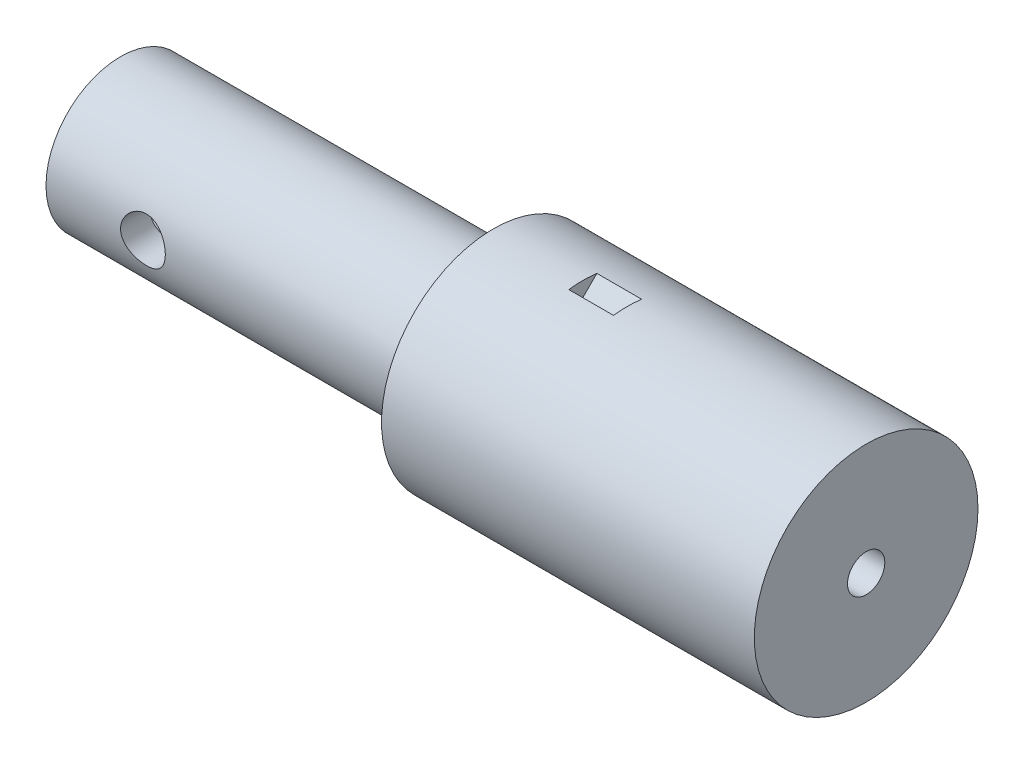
ISO-10303-21;
HEADER;
FILE_DESCRIPTION(('STEP AP214'),'2;1');
FILE_NAME('part.step','',(''),(''),'','','');
FILE_SCHEMA(('AUTOMOTIVE_DESIGN { 1 0 10303 214 1 1 1 1 }'));
ENDSEC;
DATA;
#1=APPLICATION_CONTEXT('core data for automotive mechanical design processes');
#2=APPLICATION_PROTOCOL_DEFINITION('international standard','automotive_design',2000,#1);
#3=PRODUCT_CONTEXT('',#1,'mechanical');
#4=PRODUCT('Part','Part','',(#3));
#5=PRODUCT_RELATED_PRODUCT_CATEGORY('part','',(#4));
#6=PRODUCT_DEFINITION_FORMATION('','',#4);
#7=PRODUCT_DEFINITION_CONTEXT('part definition',#1,'design');
#8=PRODUCT_DEFINITION('design','',#6,#7);
#9=PRODUCT_DEFINITION_SHAPE('','',#8);
#10=(LENGTH_UNIT() NAMED_UNIT(*) SI_UNIT(.MILLI.,.METRE.));
#11=(NAMED_UNIT(*) PLANE_ANGLE_UNIT() SI_UNIT($,.RADIAN.));
#12=(NAMED_UNIT(*) SI_UNIT($,.STERADIAN.) SOLID_ANGLE_UNIT());
#13=UNCERTAINTY_MEASURE_WITH_UNIT(LENGTH_MEASURE(1.E-05),#10,'distance_accuracy_value','');
#14=(GEOMETRIC_REPRESENTATION_CONTEXT(3) GLOBAL_UNCERTAINTY_ASSIGNED_CONTEXT((#13)) GLOBAL_UNIT_ASSIGNED_CONTEXT((#10,
#11,#12)) REPRESENTATION_CONTEXT('',''));
#15=CARTESIAN_POINT('',(0.,0.,0.));
#16=DIRECTION('',(0.,0.,1.));
#17=DIRECTION('',(1.,0.,0.));
#18=AXIS2_PLACEMENT_3D('',#15,#16,#17);
#19=CARTESIAN_POINT('',(50.,0.,0.));
#20=DIRECTION('',(-1.,0.,0.));
#21=DIRECTION('',(0.,0.,1.));
#22=AXIS2_PLACEMENT_3D('',#19,#20,#21);
#23=CYLINDRICAL_SURFACE('',#22,15.);
#24=CARTESIAN_POINT('',(0.,0.,0.));
#25=DIRECTION('',(1.,0.,0.));
#26=DIRECTION('',(0.,0.,-1.));
#27=AXIS2_PLACEMENT_3D('',#24,#25,#26);
#28=CIRCLE('',#27,15.);
#29=CARTESIAN_POINT('',(0.,0.,-15.));
#30=VERTEX_POINT('',#29);
#31=EDGE_CURVE('E162',#30,#30,#28,.T.);
#32=ORIENTED_EDGE('',*,*,#31,.T.);
#33=EDGE_LOOP('',(#32));
#34=FACE_BOUND('',#33,.T.);
#35=CARTESIAN_POINT('',(50.,0.,0.));
#36=DIRECTION('',(1.,0.,0.));
#37=DIRECTION('',(0.,0.,-1.));
#38=AXIS2_PLACEMENT_3D('',#35,#36,#37);
#39=CIRCLE('',#38,15.);
#40=CARTESIAN_POINT('',(50.,0.,-15.));
#41=VERTEX_POINT('',#40);
#42=EDGE_CURVE('E163',#41,#41,#39,.T.);
#43=ORIENTED_EDGE('',*,*,#42,.F.);
#44=EDGE_LOOP('',(#43));
#45=FACE_BOUND('',#44,.T.);
#46=CARTESIAN_POINT('',(12.,0.,0.));
#47=DIRECTION('',(1.,0.,0.));
#48=DIRECTION('',(0.,0.,-1.));
#49=AXIS2_PLACEMENT_3D('',#46,#47,#48);
#50=CIRCLE('',#49,15.);
#51=CARTESIAN_POINT('',(12.,14.8815273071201,-1.88152730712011));
#52=VERTEX_POINT('',#51);
#53=CARTESIAN_POINT('',(12.,14.8815273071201,1.88152730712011));
#54=VERTEX_POINT('',#53);
#55=EDGE_CURVE('E85',#52,#54,#50,.T.);
#56=ORIENTED_EDGE('',*,*,#55,.F.);
#57=DIRECTION('',(1.,0.,0.));
#58=VECTOR('',#57,1.);
#59=CARTESIAN_POINT('',(12.,14.8815273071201,-1.88152730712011));
#60=LINE('',#59,#58);
#61=CARTESIAN_POINT('',(18.,14.8815273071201,-1.88152730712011));
#62=VERTEX_POINT('',#61);
#63=EDGE_CURVE('E62',#52,#62,#60,.T.);
#64=ORIENTED_EDGE('',*,*,#63,.T.);
#65=CARTESIAN_POINT('',(18.,0.,0.));
#66=DIRECTION('',(1.,0.,0.));
#67=DIRECTION('',(0.,0.,-1.));
#68=AXIS2_PLACEMENT_3D('',#65,#66,#67);
#69=CIRCLE('',#68,15.);
#70=CARTESIAN_POINT('',(18.,14.8815273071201,1.88152730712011));
#71=VERTEX_POINT('',#70);
#72=EDGE_CURVE('E73',#62,#71,#69,.T.);
#73=ORIENTED_EDGE('',*,*,#72,.T.);
#74=DIRECTION('',(1.,0.,0.));
#75=VECTOR('',#74,1.);
#76=CARTESIAN_POINT('',(12.,14.8815273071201,1.88152730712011));
#77=LINE('',#76,#75);
#78=EDGE_CURVE('E81',#54,#71,#77,.T.);
#79=ORIENTED_EDGE('',*,*,#78,.F.);
#80=EDGE_LOOP('',(#56,#64,#73,#79));
#81=FACE_BOUND('',#80,.T.);
#82=ADVANCED_FACE('F32',(#34,#45,#81),#23,.T.);
#83=CARTESIAN_POINT('',(50.,0.,0.));
#84=DIRECTION('',(1.,0.,0.));
#85=DIRECTION('',(0.,0.,-1.));
#86=AXIS2_PLACEMENT_3D('',#83,#84,#85);
#87=PLANE('',#86);
#88=CARTESIAN_POINT('',(50.,0.,0.));
#89=DIRECTION('',(1.,0.,0.));
#90=DIRECTION('',(0.,0.,-1.));
#91=AXIS2_PLACEMENT_3D('',#88,#89,#90);
#92=CIRCLE('',#91,2.5);
#93=CARTESIAN_POINT('',(50.,0.,-2.5));
#94=VERTEX_POINT('',#93);
#95=EDGE_CURVE('E186',#94,#94,#92,.T.);
#96=ORIENTED_EDGE('',*,*,#95,.F.);
#97=EDGE_LOOP('',(#96));
#98=FACE_BOUND('',#97,.T.);
#99=ORIENTED_EDGE('',*,*,#42,.T.);
#100=EDGE_LOOP('',(#99));
#101=FACE_BOUND('',#100,.T.);
#102=ADVANCED_FACE('F144',(#98,#101),#87,.T.);
#103=CARTESIAN_POINT('',(0.,0.,0.));
#104=DIRECTION('',(1.,0.,0.));
#105=DIRECTION('',(0.,0.,-1.));
#106=AXIS2_PLACEMENT_3D('',#103,#104,#105);
#107=PLANE('',#106);
#108=CARTESIAN_POINT('',(0.,0.,0.));
#109=DIRECTION('',(1.,0.,0.));
#110=DIRECTION('',(0.,0.,-1.));
#111=AXIS2_PLACEMENT_3D('',#108,#109,#110);
#112=CIRCLE('',#111,10.);
#113=CARTESIAN_POINT('',(0.,0.,-10.));
#114=VERTEX_POINT('',#113);
#115=EDGE_CURVE('E160',#114,#114,#112,.F.);
#116=ORIENTED_EDGE('',*,*,#115,.F.);
#117=EDGE_LOOP('',(#116));
#118=FACE_BOUND('',#117,.T.);
#119=ORIENTED_EDGE('',*,*,#31,.F.);
#120=EDGE_LOOP('',(#119));
#121=FACE_BOUND('',#120,.T.);
#122=ADVANCED_FACE('F139',(#118,#121),#107,.F.);
#123=CARTESIAN_POINT('',(-50.,0.,0.));
#124=DIRECTION('',(1.,0.,0.));
#125=DIRECTION('',(0.,0.,-1.));
#126=AXIS2_PLACEMENT_3D('',#123,#124,#125);
#127=CYLINDRICAL_SURFACE('',#126,10.);
#128=CARTESIAN_POINT('',(-40.,0.,-10.));
#129=CARTESIAN_POINT('',(-39.9999980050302,-0.1645772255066,-9.99999858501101));
#130=CARTESIAN_POINT('',(-39.9864122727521,-0.329174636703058,-9.99589831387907));
#131=CARTESIAN_POINT('',(-39.9325572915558,-0.653576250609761,-9.97994211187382));
#132=CARTESIAN_POINT('',(-39.8922800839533,-0.813379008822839,-9.96808386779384));
#133=CARTESIAN_POINT('',(-39.7865079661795,-1.12346541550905,-9.93791105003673));
#134=CARTESIAN_POINT('',(-39.7210502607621,-1.27376272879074,-9.91960600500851));
#135=CARTESIAN_POINT('',(-39.5669278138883,-1.56124836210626,-9.87844218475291));
#136=CARTESIAN_POINT('',(-39.4782599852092,-1.69843493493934,-9.85558280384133));
#137=CARTESIAN_POINT('',(-39.2775519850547,-1.95974359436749,-9.80701474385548));
#138=CARTESIAN_POINT('',(-39.1649667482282,-2.08343614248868,-9.78124767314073));
#139=CARTESIAN_POINT('',(-38.9207815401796,-2.31049841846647,-9.73011668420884));
#140=CARTESIAN_POINT('',(-38.7891783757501,-2.41386472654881,-9.70475283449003));
#141=CARTESIAN_POINT('',(-38.5070584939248,-2.59960075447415,-9.65668227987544));
#142=CARTESIAN_POINT('',(-38.3561830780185,-2.68144618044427,-9.63404813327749));
#143=CARTESIAN_POINT('',(-38.0420214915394,-2.81842789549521,-9.59487240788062));
#144=CARTESIAN_POINT('',(-37.8787383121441,-2.87357059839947,-9.57832936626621));
#145=CARTESIAN_POINT('',(-37.5492194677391,-2.95403267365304,-9.55381741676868));
#146=CARTESIAN_POINT('',(-37.3831945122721,-2.98014392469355,-9.54562138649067));
#147=CARTESIAN_POINT('',(-37.0489336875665,-3.00427461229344,-9.53805579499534));
#148=CARTESIAN_POINT('',(-36.8806983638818,-3.00230085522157,-9.53868409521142));
#149=CARTESIAN_POINT('',(-36.553232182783,-2.97093954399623,-9.54849488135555));
#150=CARTESIAN_POINT('',(-36.3938954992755,-2.9425441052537,-9.55736777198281));
#151=CARTESIAN_POINT('',(-36.0823604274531,-2.86074840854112,-9.58216712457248));
#152=CARTESIAN_POINT('',(-35.9301627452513,-2.80734568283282,-9.59809428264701));
#153=CARTESIAN_POINT('',(-35.6347993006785,-2.67632053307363,-9.63545466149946));
#154=CARTESIAN_POINT('',(-35.4917858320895,-2.59837633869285,-9.65696032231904));
#155=CARTESIAN_POINT('',(-35.2205359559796,-2.42070445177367,-9.70301974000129));
#156=CARTESIAN_POINT('',(-35.0923031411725,-2.32097148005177,-9.72757423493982));
#157=CARTESIAN_POINT('',(-34.848627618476,-2.09762581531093,-9.77822022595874));
#158=CARTESIAN_POINT('',(-34.7339426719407,-1.97318981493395,-9.80433308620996));
#159=CARTESIAN_POINT('',(-34.5268920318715,-1.70652651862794,-9.85424488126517));
#160=CARTESIAN_POINT('',(-34.4345277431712,-1.56429810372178,-9.8780436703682));
#161=CARTESIAN_POINT('',(-34.2742801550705,-1.26471007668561,-9.92086320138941));
#162=CARTESIAN_POINT('',(-34.2065649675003,-1.1072554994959,-9.93985087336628));
#163=CARTESIAN_POINT('',(-34.0988008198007,-0.782490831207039,-9.97067043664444));
#164=CARTESIAN_POINT('',(-34.058744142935,-0.615183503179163,-9.98250432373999));
#165=CARTESIAN_POINT('',(-34.0086956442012,-0.281904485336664,-9.99736729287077));
#166=CARTESIAN_POINT('',(-33.9976768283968,-0.116100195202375,-10.0006970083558));
#167=CARTESIAN_POINT('',(-34.0031383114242,0.214999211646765,-9.99905846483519));
#168=CARTESIAN_POINT('',(-34.0196149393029,0.380294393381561,-9.99409131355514));
#169=CARTESIAN_POINT('',(-34.078769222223,0.701807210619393,-9.97661393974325));
#170=CARTESIAN_POINT('',(-34.1208467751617,0.858145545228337,-9.96427659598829));
#171=CARTESIAN_POINT('',(-34.2292864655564,1.16150927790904,-9.9334869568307));
#172=CARTESIAN_POINT('',(-34.2956515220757,1.30853355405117,-9.91503392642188));
#173=CARTESIAN_POINT('',(-34.4525063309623,1.5928743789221,-9.87339308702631));
#174=CARTESIAN_POINT('',(-34.543518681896,1.72988765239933,-9.8501056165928));
#175=CARTESIAN_POINT('',(-34.7464495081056,1.9870466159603,-9.80146937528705));
#176=CARTESIAN_POINT('',(-34.8583732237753,2.10718806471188,-9.7761200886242));
#177=CARTESIAN_POINT('',(-35.1047746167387,2.33171489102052,-9.72506343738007));
#178=CARTESIAN_POINT('',(-35.2399237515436,2.43536962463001,-9.69937650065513));
#179=CARTESIAN_POINT('',(-35.5262558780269,2.61857990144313,-9.65153030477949));
#180=CARTESIAN_POINT('',(-35.6774384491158,2.69813607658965,-9.62937095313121));
#181=CARTESIAN_POINT('',(-35.99106498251,2.83034694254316,-9.5913437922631));
#182=CARTESIAN_POINT('',(-36.1534523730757,2.88312693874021,-9.57544675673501));
#183=CARTESIAN_POINT('',(-36.4853759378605,2.96043461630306,-9.55183188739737));
#184=CARTESIAN_POINT('',(-36.6549096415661,2.98497197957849,-9.54411125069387));
#185=CARTESIAN_POINT('',(-36.9887230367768,3.0044396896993,-9.53799944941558));
#186=CARTESIAN_POINT('',(-37.1529273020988,3.00056110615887,-9.53923294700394));
#187=CARTESIAN_POINT('',(-37.4782282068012,2.9661501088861,-9.54998802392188));
#188=CARTESIAN_POINT('',(-37.639324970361,2.93561876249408,-9.55950927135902));
#189=CARTESIAN_POINT('',(-37.9518907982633,2.84953777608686,-9.58551527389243));
#190=CARTESIAN_POINT('',(-38.1034545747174,2.79430351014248,-9.60191209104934));
#191=CARTESIAN_POINT('',(-38.3952848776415,2.66063014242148,-9.63980557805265));
#192=CARTESIAN_POINT('',(-38.5355492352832,2.58218659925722,-9.6613032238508));
#193=CARTESIAN_POINT('',(-38.8063262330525,2.40097527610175,-9.70795352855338));
#194=CARTESIAN_POINT('',(-38.9362975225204,2.29742552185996,-9.7332108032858));
#195=CARTESIAN_POINT('',(-39.1774049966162,2.07034869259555,-9.78402640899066));
#196=CARTESIAN_POINT('',(-39.2885362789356,1.94681643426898,-9.80958481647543));
#197=CARTESIAN_POINT('',(-39.4920468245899,1.67893152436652,-9.85901873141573));
#198=CARTESIAN_POINT('',(-39.583782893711,1.53407577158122,-9.88282319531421));
#199=CARTESIAN_POINT('',(-39.7414703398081,1.23028274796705,-9.92521360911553));
#200=CARTESIAN_POINT('',(-39.807433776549,1.07135210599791,-9.94380199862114));
#201=CARTESIAN_POINT('',(-39.9057905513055,0.761515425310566,-9.97204349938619));
#202=CARTESIAN_POINT('',(-39.9410233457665,0.61157392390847,-9.9824405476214));
#203=CARTESIAN_POINT('',(-39.9881270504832,0.307760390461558,-9.9964188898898));
#204=CARTESIAN_POINT('',(-40.0000018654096,0.153889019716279,-10.0000013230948));
#205=CARTESIAN_POINT('',(-40.,0.,-10.));
#206=B_SPLINE_CURVE_WITH_KNOTS('',3,(#128,#129,#130,#131,#132,#133,#134,#135,#136,#137,#138,
#139,#140,#141,#142,#143,#144,#145,#146,#147,#148,#149,#150,#151,#152,#153,#154,#155,#156,#157,
#158,#159,#160,#161,#162,#163,#164,#165,#166,#167,#168,#169,#170,#171,#172,#173,#174,#175,#176,
#177,#178,#179,#180,#181,#182,#183,#184,#185,#186,#187,#188,#189,#190,#191,#192,#193,#194,#195,
#196,#197,#198,#199,#200,#201,#202,#203,#204,#205),.UNSPECIFIED.,.T.,.F.,(4,2,2,2,2,2,2,2,2,2,2,
2,2,2,2,2,2,2,2,2,2,2,2,2,2,2,2,2,2,2,2,2,2,2,2,2,2,2,4),(0.,0.49316640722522,0.986479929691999,
1.47906735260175,1.9717203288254,2.47711205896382,2.98258874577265,3.49942962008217,
4.01614629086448,4.51839378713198,5.02051956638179,5.50452033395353,5.98856887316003,
6.47924852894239,6.97004720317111,7.48134208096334,7.99266913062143,8.50742093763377,
9.02202907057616,9.5181761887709,10.0142570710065,10.4991349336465,10.9840710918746,
11.4802261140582,11.9765056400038,12.4908080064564,13.0050968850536,13.516956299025,
14.0286401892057,14.5190031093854,15.0093463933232,15.4936008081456,15.9779479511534,
16.4799385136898,16.9820594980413,17.4988599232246,18.0154182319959,18.4766338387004,
18.9377723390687),.UNSPECIFIED.);
#207=CARTESIAN_POINT('',(-40.,0.,-10.));
#208=VERTEX_POINT('',#207);
#209=EDGE_CURVE('E103',#208,#208,#206,.T.);
#210=ORIENTED_EDGE('',*,*,#209,.T.);
#211=EDGE_LOOP('',(#210));
#212=FACE_BOUND('',#211,.T.);
#213=CARTESIAN_POINT('',(-34.,0.,10.));
#214=CARTESIAN_POINT('',(-34.0000019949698,-0.164577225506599,9.99999858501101));
#215=CARTESIAN_POINT('',(-34.0135877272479,-0.329174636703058,9.99589831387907));
#216=CARTESIAN_POINT('',(-34.0674427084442,-0.65357625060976,9.97994211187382));
#217=CARTESIAN_POINT('',(-34.1077199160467,-0.813379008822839,9.96808386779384));
#218=CARTESIAN_POINT('',(-34.2134920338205,-1.12346541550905,9.93791105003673));
#219=CARTESIAN_POINT('',(-34.2789497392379,-1.27376272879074,9.91960600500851));
#220=CARTESIAN_POINT('',(-34.4330721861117,-1.56124836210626,9.87844218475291));
#221=CARTESIAN_POINT('',(-34.5217400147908,-1.69843493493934,9.85558280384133));
#222=CARTESIAN_POINT('',(-34.7224480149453,-1.95974359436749,9.80701474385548));
#223=CARTESIAN_POINT('',(-34.8350332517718,-2.08343614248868,9.78124767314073));
#224=CARTESIAN_POINT('',(-35.0792184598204,-2.31049841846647,9.73011668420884));
#225=CARTESIAN_POINT('',(-35.2108216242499,-2.41386472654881,9.70475283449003));
#226=CARTESIAN_POINT('',(-35.4929415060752,-2.59960075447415,9.65668227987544));
#227=CARTESIAN_POINT('',(-35.6438169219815,-2.68144618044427,9.63404813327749));
#228=CARTESIAN_POINT('',(-35.9579785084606,-2.81842789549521,9.59487240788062));
#229=CARTESIAN_POINT('',(-36.121261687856,-2.87357059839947,9.57832936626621));
#230=CARTESIAN_POINT('',(-36.4507805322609,-2.95403267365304,9.55381741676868));
#231=CARTESIAN_POINT('',(-36.6168054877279,-2.98014392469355,9.54562138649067));
#232=CARTESIAN_POINT('',(-36.9510663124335,-3.00427461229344,9.53805579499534));
#233=CARTESIAN_POINT('',(-37.1193016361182,-3.00230085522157,9.53868409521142));
#234=CARTESIAN_POINT('',(-37.446767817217,-2.97093954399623,9.54849488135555));
#235=CARTESIAN_POINT('',(-37.6061045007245,-2.9425441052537,9.55736777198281));
#236=CARTESIAN_POINT('',(-37.9176395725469,-2.86074840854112,9.58216712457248));
#237=CARTESIAN_POINT('',(-38.0698372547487,-2.80734568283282,9.59809428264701));
#238=CARTESIAN_POINT('',(-38.3652006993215,-2.67632053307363,9.63545466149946));
#239=CARTESIAN_POINT('',(-38.5082141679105,-2.59837633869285,9.65696032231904));
#240=CARTESIAN_POINT('',(-38.7794640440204,-2.42070445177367,9.70301974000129));
#241=CARTESIAN_POINT('',(-38.9076968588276,-2.32097148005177,9.72757423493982));
#242=CARTESIAN_POINT('',(-39.151372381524,-2.09762581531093,9.77822022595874));
#243=CARTESIAN_POINT('',(-39.2660573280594,-1.97318981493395,9.80433308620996));
#244=CARTESIAN_POINT('',(-39.4731079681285,-1.70652651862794,9.85424488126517));
#245=CARTESIAN_POINT('',(-39.5654722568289,-1.56429810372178,9.8780436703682));
#246=CARTESIAN_POINT('',(-39.7257198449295,-1.26471007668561,9.92086320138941));
#247=CARTESIAN_POINT('',(-39.7934350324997,-1.1072554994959,9.93985087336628));
#248=CARTESIAN_POINT('',(-39.9011991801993,-0.782490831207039,9.97067043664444));
#249=CARTESIAN_POINT('',(-39.941255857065,-0.615183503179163,9.98250432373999));
#250=CARTESIAN_POINT('',(-39.9913043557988,-0.281904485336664,9.99736729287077));
#251=CARTESIAN_POINT('',(-40.0023231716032,-0.116100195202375,10.0006970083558));
#252=CARTESIAN_POINT('',(-39.9968616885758,0.214999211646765,9.99905846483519));
#253=CARTESIAN_POINT('',(-39.9803850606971,0.380294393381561,9.99409131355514));
#254=CARTESIAN_POINT('',(-39.921230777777,0.701807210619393,9.97661393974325));
#255=CARTESIAN_POINT('',(-39.8791532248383,0.858145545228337,9.96427659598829));
#256=CARTESIAN_POINT('',(-39.7707135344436,1.16150927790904,9.9334869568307));
#257=CARTESIAN_POINT('',(-39.7043484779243,1.30853355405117,9.91503392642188));
#258=CARTESIAN_POINT('',(-39.5474936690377,1.5928743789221,9.87339308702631));
#259=CARTESIAN_POINT('',(-39.4564813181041,1.72988765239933,9.8501056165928));
#260=CARTESIAN_POINT('',(-39.2535504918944,1.9870466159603,9.80146937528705));
#261=CARTESIAN_POINT('',(-39.1416267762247,2.10718806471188,9.7761200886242));
#262=CARTESIAN_POINT('',(-38.8952253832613,2.33171489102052,9.72506343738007));
#263=CARTESIAN_POINT('',(-38.7600762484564,2.43536962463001,9.69937650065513));
#264=CARTESIAN_POINT('',(-38.4737441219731,2.61857990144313,9.65153030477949));
#265=CARTESIAN_POINT('',(-38.3225615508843,2.69813607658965,9.62937095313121));
#266=CARTESIAN_POINT('',(-38.00893501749,2.83034694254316,9.5913437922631));
#267=CARTESIAN_POINT('',(-37.8465476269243,2.88312693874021,9.57544675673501));
#268=CARTESIAN_POINT('',(-37.5146240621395,2.96043461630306,9.55183188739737));
#269=CARTESIAN_POINT('',(-37.3450903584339,2.98497197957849,9.54411125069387));
#270=CARTESIAN_POINT('',(-37.0112769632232,3.0044396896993,9.53799944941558));
#271=CARTESIAN_POINT('',(-36.8470726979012,3.00056110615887,9.53923294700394));
#272=CARTESIAN_POINT('',(-36.5217717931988,2.9661501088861,9.54998802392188));
#273=CARTESIAN_POINT('',(-36.360675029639,2.93561876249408,9.55950927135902));
#274=CARTESIAN_POINT('',(-36.0481092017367,2.84953777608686,9.58551527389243));
#275=CARTESIAN_POINT('',(-35.8965454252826,2.79430351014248,9.60191209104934));
#276=CARTESIAN_POINT('',(-35.6047151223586,2.66063014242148,9.63980557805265));
#277=CARTESIAN_POINT('',(-35.4644507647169,2.58218659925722,9.6613032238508));
#278=CARTESIAN_POINT('',(-35.1936737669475,2.40097527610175,9.70795352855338));
#279=CARTESIAN_POINT('',(-35.0637024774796,2.29742552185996,9.7332108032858));
#280=CARTESIAN_POINT('',(-34.8225950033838,2.07034869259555,9.78402640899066));
#281=CARTESIAN_POINT('',(-34.7114637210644,1.94681643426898,9.80958481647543));
#282=CARTESIAN_POINT('',(-34.5079531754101,1.67893152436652,9.85901873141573));
#283=CARTESIAN_POINT('',(-34.4162171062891,1.53407577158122,9.88282319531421));
#284=CARTESIAN_POINT('',(-34.2585296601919,1.23028274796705,9.92521360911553));
#285=CARTESIAN_POINT('',(-34.192566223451,1.07135210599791,9.94380199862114));
#286=CARTESIAN_POINT('',(-34.0942094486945,0.761515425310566,9.97204349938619));
#287=CARTESIAN_POINT('',(-34.0589766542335,0.61157392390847,9.9824405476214));
#288=CARTESIAN_POINT('',(-34.0118729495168,0.307760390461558,9.9964188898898));
#289=CARTESIAN_POINT('',(-33.9999981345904,0.153889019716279,10.0000013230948));
#290=CARTESIAN_POINT('',(-34.,0.,10.));
#291=B_SPLINE_CURVE_WITH_KNOTS('',3,(#213,#214,#215,#216,#217,#218,#219,#220,#221,#222,#223,
#224,#225,#226,#227,#228,#229,#230,#231,#232,#233,#234,#235,#236,#237,#238,#239,#240,#241,#242,
#243,#244,#245,#246,#247,#248,#249,#250,#251,#252,#253,#254,#255,#256,#257,#258,#259,#260,#261,
#262,#263,#264,#265,#266,#267,#268,#269,#270,#271,#272,#273,#274,#275,#276,#277,#278,#279,#280,
#281,#282,#283,#284,#285,#286,#287,#288,#289,#290),.UNSPECIFIED.,.T.,.F.,(4,2,2,2,2,2,2,2,2,2,2,
2,2,2,2,2,2,2,2,2,2,2,2,2,2,2,2,2,2,2,2,2,2,2,2,2,2,2,4),(0.,0.493166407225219,
0.986479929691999,1.47906735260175,1.9717203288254,2.47711205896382,2.98258874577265,
3.49942962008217,4.01614629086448,4.51839378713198,5.02051956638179,5.50452033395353,
5.98856887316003,6.4792485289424,6.97004720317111,7.48134208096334,7.99266913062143,
8.50742093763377,9.02202907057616,9.5181761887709,10.0142570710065,10.4991349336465,
10.9840710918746,11.4802261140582,11.9765056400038,12.4908080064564,13.0050968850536,
13.516956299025,14.0286401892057,14.5190031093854,15.0093463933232,15.4936008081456,
15.9779479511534,16.4799385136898,16.9820594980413,17.4988599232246,18.0154182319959,
18.4766338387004,18.9377723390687),.UNSPECIFIED.);
#292=CARTESIAN_POINT('',(-34.,0.,10.));
#293=VERTEX_POINT('',#292);
#294=EDGE_CURVE('E97',#293,#293,#291,.T.);
#295=ORIENTED_EDGE('',*,*,#294,.T.);
#296=EDGE_LOOP('',(#295));
#297=FACE_BOUND('',#296,.T.);
#298=CARTESIAN_POINT('',(-50.,0.,0.));
#299=DIRECTION('',(-1.,0.,0.));
#300=DIRECTION('',(0.,0.,1.));
#301=AXIS2_PLACEMENT_3D('',#298,#299,#300);
#302=CIRCLE('',#301,10.);
#303=CARTESIAN_POINT('',(-50.,0.,10.));
#304=VERTEX_POINT('',#303);
#305=EDGE_CURVE('E164',#304,#304,#302,.T.);
#306=ORIENTED_EDGE('',*,*,#305,.F.);
#307=EDGE_LOOP('',(#306));
#308=FACE_BOUND('',#307,.T.);
#309=ORIENTED_EDGE('',*,*,#115,.T.);
#310=EDGE_LOOP('',(#309));
#311=FACE_BOUND('',#310,.T.);
#312=ADVANCED_FACE('F107',(#212,#297,#308,#311),#127,.T.);
#313=CARTESIAN_POINT('',(-50.,0.,0.));
#314=DIRECTION('',(-1.,0.,0.));
#315=DIRECTION('',(0.,0.,1.));
#316=AXIS2_PLACEMENT_3D('',#313,#314,#315);
#317=PLANE('',#316);
#318=CARTESIAN_POINT('',(-50.,0.,0.));
#319=DIRECTION('',(-1.,0.,0.));
#320=DIRECTION('',(0.,0.,1.));
#321=AXIS2_PLACEMENT_3D('',#318,#319,#320);
#322=CIRCLE('',#321,6.);
#323=CARTESIAN_POINT('',(-50.,0.,6.));
#324=VERTEX_POINT('',#323);
#325=EDGE_CURVE('E169',#324,#324,#322,.T.);
#326=ORIENTED_EDGE('',*,*,#325,.F.);
#327=EDGE_LOOP('',(#326));
#328=FACE_BOUND('',#327,.T.);
#329=ORIENTED_EDGE('',*,*,#305,.T.);
#330=EDGE_LOOP('',(#329));
#331=FACE_BOUND('',#330,.T.);
#332=ADVANCED_FACE('F131',(#328,#331),#317,.T.);
#333=CARTESIAN_POINT('',(29.1,0.,0.));
#334=DIRECTION('',(-1.,0.,0.));
#335=DIRECTION('',(0.,0.,1.));
#336=AXIS2_PLACEMENT_3D('',#333,#334,#335);
#337=CYLINDRICAL_SURFACE('',#336,6.);
#338=CARTESIAN_POINT('',(-34.,0.,6.));
#339=CARTESIAN_POINT('',(-34.0000008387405,0.0788941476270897,5.99999934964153));
#340=CARTESIAN_POINT('',(-34.0031179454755,0.157796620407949,5.99843869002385));
#341=CARTESIAN_POINT('',(-34.01553927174,0.315001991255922,5.99224358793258));
#342=CARTESIAN_POINT('',(-34.0248462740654,0.393304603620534,5.98760776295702));
#343=CARTESIAN_POINT('',(-34.0619578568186,0.626628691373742,5.96921978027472));
#344=CARTESIAN_POINT('',(-34.0989528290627,0.77995289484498,5.95098734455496));
#345=CARTESIAN_POINT('',(-34.1955817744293,1.07683586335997,5.90448966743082));
#346=CARTESIAN_POINT('',(-34.2551277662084,1.22043005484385,5.87626344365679));
#347=CARTESIAN_POINT('',(-34.3947112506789,1.49540820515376,5.81237302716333));
#348=CARTESIAN_POINT('',(-34.4747471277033,1.62679312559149,5.77670942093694));
#349=CARTESIAN_POINT('',(-34.6585539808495,1.88252701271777,5.69868752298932));
#350=CARTESIAN_POINT('',(-34.7634679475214,2.0059694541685,5.65605474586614));
#351=CARTESIAN_POINT('',(-34.9915559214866,2.23433451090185,5.56980033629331));
#352=CARTESIAN_POINT('',(-35.1147437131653,2.33924301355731,5.5261779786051));
#353=CARTESIAN_POINT('',(-35.3874843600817,2.53576864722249,5.43896347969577));
#354=CARTESIAN_POINT('',(-35.5383409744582,2.62572411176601,5.39563602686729));
#355=CARTESIAN_POINT('',(-35.7759508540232,2.7403403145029,5.33782449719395));
#356=CARTESIAN_POINT('',(-35.8570709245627,2.77516786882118,5.31974570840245));
#357=CARTESIAN_POINT('',(-36.0226005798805,2.83769299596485,5.28665768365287));
#358=CARTESIAN_POINT('',(-36.1070081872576,2.86539478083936,5.27164663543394));
#359=CARTESIAN_POINT('',(-36.2733957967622,2.91188280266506,5.24610341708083));
#360=CARTESIAN_POINT('',(-36.3552227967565,2.93110042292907,5.23535838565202));
#361=CARTESIAN_POINT('',(-36.5205549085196,2.9626355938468,5.21757784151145));
#362=CARTESIAN_POINT('',(-36.6040591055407,2.9749568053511,5.21054036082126));
#363=CARTESIAN_POINT('',(-36.7720063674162,2.99251382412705,5.20047756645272));
#364=CARTESIAN_POINT('',(-36.8564488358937,2.99775389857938,5.19744983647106));
#365=CARTESIAN_POINT('',(-37.0254936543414,3.00108452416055,5.19552555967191));
#366=CARTESIAN_POINT('',(-37.1100959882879,2.99917575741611,5.19662861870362));
#367=CARTESIAN_POINT('',(-37.3427538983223,2.98404973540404,5.20534668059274));
#368=CARTESIAN_POINT('',(-37.4902441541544,2.96335042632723,5.21726794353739));
#369=CARTESIAN_POINT('',(-37.7791936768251,2.90082280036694,5.25228182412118));
#370=CARTESIAN_POINT('',(-37.9206510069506,2.85898775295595,5.2753780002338));
#371=CARTESIAN_POINT('',(-38.1976796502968,2.75462843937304,5.33062568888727));
#372=CARTESIAN_POINT('',(-38.3330371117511,2.69164495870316,5.36297559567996));
#373=CARTESIAN_POINT('',(-38.591904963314,2.54712530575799,5.43310175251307));
#374=CARTESIAN_POINT('',(-38.7154099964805,2.46558080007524,5.47088043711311));
#375=CARTESIAN_POINT('',(-38.9635630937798,2.27419808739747,5.55339485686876));
#376=CARTESIAN_POINT('',(-39.0863704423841,2.16208335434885,5.59840533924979));
#377=CARTESIAN_POINT('',(-39.3122064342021,1.91866675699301,5.68642866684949));
#378=CARTESIAN_POINT('',(-39.4152256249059,1.78735577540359,5.72944054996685));
#379=CARTESIAN_POINT('',(-39.6030569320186,1.50154951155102,5.81105962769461));
#380=CARTESIAN_POINT('',(-39.6868014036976,1.3462607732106,5.84936952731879));
#381=CARTESIAN_POINT('',(-39.8262911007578,1.02139864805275,5.91473643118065));
#382=CARTESIAN_POINT('',(-39.8820585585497,0.851836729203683,5.94180236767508));
#383=CARTESIAN_POINT('',(-39.9594262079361,0.518299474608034,5.97973001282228));
#384=CARTESIAN_POINT('',(-39.9834737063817,0.355024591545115,5.99174814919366));
#385=CARTESIAN_POINT('',(-40.0043941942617,0.0263387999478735,6.00219040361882));
#386=CARTESIAN_POINT('',(-40.0012800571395,-0.139071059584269,6.00062096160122));
#387=CARTESIAN_POINT('',(-39.9693799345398,-0.453698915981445,5.98473576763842));
#388=CARTESIAN_POINT('',(-39.9426024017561,-0.603178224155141,5.97141737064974));
#389=CARTESIAN_POINT('',(-39.8672857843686,-0.895220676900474,5.93466513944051));
#390=CARTESIAN_POINT('',(-39.8187443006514,-1.03778305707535,5.91123019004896));
#391=CARTESIAN_POINT('',(-39.7000046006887,-1.31666582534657,5.85552754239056));
#392=CARTESIAN_POINT('',(-39.6292268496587,-1.45269119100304,5.82302645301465));
#393=CARTESIAN_POINT('',(-39.4686773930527,-1.71138408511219,5.75231922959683));
#394=CARTESIAN_POINT('',(-39.3788975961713,-1.83404588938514,5.71411066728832));
#395=CARTESIAN_POINT('',(-39.1727187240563,-2.07530306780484,5.63124663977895));
#396=CARTESIAN_POINT('',(-39.0545713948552,-2.19231623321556,5.58632654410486));
#397=CARTESIAN_POINT('',(-38.8002245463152,-2.40556896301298,5.49787174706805));
#398=CARTESIAN_POINT('',(-38.6640126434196,-2.50179415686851,5.4543380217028));
#399=CARTESIAN_POINT('',(-38.3690690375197,-2.675123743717,5.37153576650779));
#400=CARTESIAN_POINT('',(-38.2095662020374,-2.75107648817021,5.33257588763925));
#401=CARTESIAN_POINT('',(-37.8774697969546,-2.87424847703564,5.26722216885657));
#402=CARTESIAN_POINT('',(-37.7048934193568,-2.92150474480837,5.24081214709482));
#403=CARTESIAN_POINT('',(-37.3692693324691,-2.98158506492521,5.2068450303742));
#404=CARTESIAN_POINT('',(-37.2068972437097,-2.997278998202,5.19772150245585));
#405=CARTESIAN_POINT('',(-36.8816587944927,-3.00206745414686,5.19496064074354));
#406=CARTESIAN_POINT('',(-36.7187926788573,-2.99117350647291,5.20131659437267));
#407=CARTESIAN_POINT('',(-36.4135495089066,-2.94577840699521,5.22713585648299));
#408=CARTESIAN_POINT('',(-36.2706986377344,-2.91362505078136,5.24529281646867));
#409=CARTESIAN_POINT('',(-35.9925755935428,-2.82952596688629,5.29113050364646));
#410=CARTESIAN_POINT('',(-35.857305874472,-2.77757387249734,5.3188142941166));
#411=CARTESIAN_POINT('',(-35.5881256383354,-2.65144766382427,5.38285583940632));
#412=CARTESIAN_POINT('',(-35.4549170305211,-2.57601505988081,5.41967139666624));
#413=CARTESIAN_POINT('',(-35.2021756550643,-2.40645126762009,5.49706022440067));
#414=CARTESIAN_POINT('',(-35.0826500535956,-2.31231035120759,5.53763544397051));
#415=CARTESIAN_POINT('',(-34.8455771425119,-2.094616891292,5.62386853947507));
#416=CARTESIAN_POINT('',(-34.7300348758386,-1.96888052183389,5.66954494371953));
#417=CARTESIAN_POINT('',(-34.521198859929,-1.69843715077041,5.75633712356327));
#418=CARTESIAN_POINT('',(-34.4279171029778,-1.55371998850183,5.79745043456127));
#419=CARTESIAN_POINT('',(-34.3068218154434,-1.32452333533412,5.85251406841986));
#420=CARTESIAN_POINT('',(-34.2694797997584,-1.24575314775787,5.86982524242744));
#421=CARTESIAN_POINT('',(-34.2016383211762,-1.08479725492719,5.90168845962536));
#422=CARTESIAN_POINT('',(-34.1711355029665,-1.00261324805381,5.91624185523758));
#423=CARTESIAN_POINT('',(-34.1173927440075,-0.835616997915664,5.94212690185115));
#424=CARTESIAN_POINT('',(-34.094136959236,-0.750810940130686,5.95346557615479));
#425=CARTESIAN_POINT('',(-34.0551174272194,-0.579142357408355,5.97260771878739));
#426=CARTESIAN_POINT('',(-34.0393491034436,-0.492281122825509,5.98041334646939));
#427=CARTESIAN_POINT('',(-34.0183153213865,-0.337824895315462,5.99085829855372));
#428=CARTESIAN_POINT('',(-34.011453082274,-0.270495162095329,5.99428035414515));
#429=CARTESIAN_POINT('',(-34.0022949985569,-0.13544567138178,5.99885151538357));
#430=CARTESIAN_POINT('',(-33.9999992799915,-0.067725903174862,6.00000055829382));
#431=CARTESIAN_POINT('',(-34.,0.,6.));
#432=B_SPLINE_CURVE_WITH_KNOTS('',3,(#338,#339,#340,#341,#342,#343,#344,#345,#346,#347,#348,
#349,#350,#351,#352,#353,#354,#355,#356,#357,#358,#359,#360,#361,#362,#363,#364,#365,#366,#367,
#368,#369,#370,#371,#372,#373,#374,#375,#376,#377,#378,#379,#380,#381,#382,#383,#384,#385,#386,
#387,#388,#389,#390,#391,#392,#393,#394,#395,#396,#397,#398,#399,#400,#401,#402,#403,#404,#405,
#406,#407,#408,#409,#410,#411,#412,#413,#414,#415,#416,#417,#418,#419,#420,#421,#422,#423,#424,
#425,#426,#427,#428,#429,#430,#431),.UNSPECIFIED.,.T.,.F.,(4,2,2,2,2,2,2,2,2,2,2,2,2,2,2,2,2,2,
2,2,2,2,2,2,2,2,2,2,2,2,2,2,2,2,2,2,2,2,2,2,2,2,2,2,2,2,4),(0.,0.236611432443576,
0.473329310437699,0.947100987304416,1.41904300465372,1.89094781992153,2.39140181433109,
2.89223525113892,3.4319083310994,3.70192714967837,3.97178599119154,4.22563720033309,
4.47935352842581,4.73291689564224,4.98645606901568,5.43238672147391,5.87845946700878,
6.33492255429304,6.79159098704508,7.30616358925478,7.82098138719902,8.35970601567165,
8.89800185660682,9.3917140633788,9.88519228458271,10.3404225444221,10.7957029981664,
11.2640010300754,11.7324988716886,12.2470036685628,12.7618630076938,13.3016558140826,
13.8407507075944,14.3280945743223,14.8152271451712,15.2559532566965,15.6968212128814,
16.1673090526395,16.6380421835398,17.1659726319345,17.6941868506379,17.9605054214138,
18.2266930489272,18.4922945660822,18.7577335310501,18.9608446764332,19.1639614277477),.UNSPECIFIED.);
#433=CARTESIAN_POINT('',(-34.,0.,6.));
#434=VERTEX_POINT('',#433);
#435=EDGE_CURVE('E36',#434,#434,#432,.T.);
#436=ORIENTED_EDGE('',*,*,#435,.T.);
#437=EDGE_LOOP('',(#436));
#438=FACE_BOUND('',#437,.T.);
#439=CARTESIAN_POINT('',(-34.,0.,-6.));
#440=CARTESIAN_POINT('',(-34.0000008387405,-0.0788941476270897,-5.99999934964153));
#441=CARTESIAN_POINT('',(-34.0031179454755,-0.157796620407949,-5.99843869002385));
#442=CARTESIAN_POINT('',(-34.01553927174,-0.315001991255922,-5.99224358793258));
#443=CARTESIAN_POINT('',(-34.0248462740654,-0.393304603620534,-5.98760776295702));
#444=CARTESIAN_POINT('',(-34.0619578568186,-0.626628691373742,-5.96921978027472));
#445=CARTESIAN_POINT('',(-34.0989528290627,-0.77995289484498,-5.95098734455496));
#446=CARTESIAN_POINT('',(-34.1955817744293,-1.07683586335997,-5.90448966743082));
#447=CARTESIAN_POINT('',(-34.2551277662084,-1.22043005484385,-5.87626344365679));
#448=CARTESIAN_POINT('',(-34.3947112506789,-1.49540820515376,-5.81237302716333));
#449=CARTESIAN_POINT('',(-34.4747471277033,-1.62679312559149,-5.77670942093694));
#450=CARTESIAN_POINT('',(-34.6585539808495,-1.88252701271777,-5.69868752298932));
#451=CARTESIAN_POINT('',(-34.7634679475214,-2.0059694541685,-5.65605474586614));
#452=CARTESIAN_POINT('',(-34.9915559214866,-2.23433451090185,-5.56980033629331));
#453=CARTESIAN_POINT('',(-35.1147437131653,-2.33924301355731,-5.5261779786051));
#454=CARTESIAN_POINT('',(-35.3874843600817,-2.53576864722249,-5.43896347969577));
#455=CARTESIAN_POINT('',(-35.5383409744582,-2.62572411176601,-5.39563602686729));
#456=CARTESIAN_POINT('',(-35.7759508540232,-2.7403403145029,-5.33782449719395));
#457=CARTESIAN_POINT('',(-35.8570709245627,-2.77516786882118,-5.31974570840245));
#458=CARTESIAN_POINT('',(-36.0226005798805,-2.83769299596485,-5.28665768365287));
#459=CARTESIAN_POINT('',(-36.1070081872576,-2.86539478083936,-5.27164663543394));
#460=CARTESIAN_POINT('',(-36.2733957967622,-2.91188280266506,-5.24610341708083));
#461=CARTESIAN_POINT('',(-36.3552227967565,-2.93110042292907,-5.23535838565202));
#462=CARTESIAN_POINT('',(-36.5205549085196,-2.9626355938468,-5.21757784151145));
#463=CARTESIAN_POINT('',(-36.6040591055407,-2.9749568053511,-5.21054036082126));
#464=CARTESIAN_POINT('',(-36.7720063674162,-2.99251382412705,-5.20047756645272));
#465=CARTESIAN_POINT('',(-36.8564488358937,-2.99775389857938,-5.19744983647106));
#466=CARTESIAN_POINT('',(-37.0254936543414,-3.00108452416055,-5.19552555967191));
#467=CARTESIAN_POINT('',(-37.1100959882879,-2.99917575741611,-5.19662861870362));
#468=CARTESIAN_POINT('',(-37.3427538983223,-2.98404973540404,-5.20534668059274));
#469=CARTESIAN_POINT('',(-37.4902441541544,-2.96335042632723,-5.21726794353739));
#470=CARTESIAN_POINT('',(-37.7791936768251,-2.90082280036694,-5.25228182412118));
#471=CARTESIAN_POINT('',(-37.9206510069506,-2.85898775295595,-5.2753780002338));
#472=CARTESIAN_POINT('',(-38.1976796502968,-2.75462843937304,-5.33062568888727));
#473=CARTESIAN_POINT('',(-38.3330371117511,-2.69164495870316,-5.36297559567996));
#474=CARTESIAN_POINT('',(-38.591904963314,-2.54712530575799,-5.43310175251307));
#475=CARTESIAN_POINT('',(-38.7154099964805,-2.46558080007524,-5.47088043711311));
#476=CARTESIAN_POINT('',(-38.9635630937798,-2.27419808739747,-5.55339485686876));
#477=CARTESIAN_POINT('',(-39.0863704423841,-2.16208335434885,-5.59840533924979));
#478=CARTESIAN_POINT('',(-39.3122064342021,-1.91866675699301,-5.68642866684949));
#479=CARTESIAN_POINT('',(-39.4152256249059,-1.78735577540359,-5.72944054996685));
#480=CARTESIAN_POINT('',(-39.6030569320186,-1.50154951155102,-5.81105962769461));
#481=CARTESIAN_POINT('',(-39.6868014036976,-1.3462607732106,-5.84936952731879));
#482=CARTESIAN_POINT('',(-39.8262911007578,-1.02139864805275,-5.91473643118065));
#483=CARTESIAN_POINT('',(-39.8820585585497,-0.851836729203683,-5.94180236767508));
#484=CARTESIAN_POINT('',(-39.9594262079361,-0.518299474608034,-5.97973001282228));
#485=CARTESIAN_POINT('',(-39.9834737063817,-0.355024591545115,-5.99174814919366));
#486=CARTESIAN_POINT('',(-40.0043941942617,-0.0263387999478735,-6.00219040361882));
#487=CARTESIAN_POINT('',(-40.0012800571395,0.139071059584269,-6.00062096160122));
#488=CARTESIAN_POINT('',(-39.9693799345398,0.453698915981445,-5.98473576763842));
#489=CARTESIAN_POINT('',(-39.9426024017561,0.603178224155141,-5.97141737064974));
#490=CARTESIAN_POINT('',(-39.8672857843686,0.895220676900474,-5.93466513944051));
#491=CARTESIAN_POINT('',(-39.8187443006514,1.03778305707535,-5.91123019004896));
#492=CARTESIAN_POINT('',(-39.7000046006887,1.31666582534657,-5.85552754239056));
#493=CARTESIAN_POINT('',(-39.6292268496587,1.45269119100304,-5.82302645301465));
#494=CARTESIAN_POINT('',(-39.4686773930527,1.71138408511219,-5.75231922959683));
#495=CARTESIAN_POINT('',(-39.3788975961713,1.83404588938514,-5.71411066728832));
#496=CARTESIAN_POINT('',(-39.1727187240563,2.07530306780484,-5.63124663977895));
#497=CARTESIAN_POINT('',(-39.0545713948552,2.19231623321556,-5.58632654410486));
#498=CARTESIAN_POINT('',(-38.8002245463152,2.40556896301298,-5.49787174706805));
#499=CARTESIAN_POINT('',(-38.6640126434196,2.50179415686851,-5.4543380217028));
#500=CARTESIAN_POINT('',(-38.3690690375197,2.675123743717,-5.37153576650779));
#501=CARTESIAN_POINT('',(-38.2095662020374,2.75107648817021,-5.33257588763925));
#502=CARTESIAN_POINT('',(-37.8774697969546,2.87424847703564,-5.26722216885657));
#503=CARTESIAN_POINT('',(-37.7048934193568,2.92150474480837,-5.24081214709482));
#504=CARTESIAN_POINT('',(-37.3692693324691,2.98158506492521,-5.2068450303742));
#505=CARTESIAN_POINT('',(-37.2068972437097,2.997278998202,-5.19772150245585));
#506=CARTESIAN_POINT('',(-36.8816587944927,3.00206745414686,-5.19496064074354));
#507=CARTESIAN_POINT('',(-36.7187926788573,2.99117350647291,-5.20131659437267));
#508=CARTESIAN_POINT('',(-36.4135495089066,2.94577840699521,-5.22713585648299));
#509=CARTESIAN_POINT('',(-36.2706986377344,2.91362505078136,-5.24529281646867));
#510=CARTESIAN_POINT('',(-35.9925755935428,2.82952596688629,-5.29113050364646));
#511=CARTESIAN_POINT('',(-35.857305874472,2.77757387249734,-5.3188142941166));
#512=CARTESIAN_POINT('',(-35.5881256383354,2.65144766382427,-5.38285583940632));
#513=CARTESIAN_POINT('',(-35.4549170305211,2.57601505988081,-5.41967139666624));
#514=CARTESIAN_POINT('',(-35.2021756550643,2.40645126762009,-5.49706022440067));
#515=CARTESIAN_POINT('',(-35.0826500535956,2.31231035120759,-5.53763544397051));
#516=CARTESIAN_POINT('',(-34.8455771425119,2.094616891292,-5.62386853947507));
#517=CARTESIAN_POINT('',(-34.7300348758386,1.96888052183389,-5.66954494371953));
#518=CARTESIAN_POINT('',(-34.521198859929,1.69843715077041,-5.75633712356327));
#519=CARTESIAN_POINT('',(-34.4279171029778,1.55371998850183,-5.79745043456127));
#520=CARTESIAN_POINT('',(-34.3068218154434,1.32452333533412,-5.85251406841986));
#521=CARTESIAN_POINT('',(-34.2694797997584,1.24575314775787,-5.86982524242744));
#522=CARTESIAN_POINT('',(-34.2016383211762,1.08479725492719,-5.90168845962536));
#523=CARTESIAN_POINT('',(-34.1711355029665,1.00261324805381,-5.91624185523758));
#524=CARTESIAN_POINT('',(-34.1173927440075,0.835616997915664,-5.94212690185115));
#525=CARTESIAN_POINT('',(-34.094136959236,0.750810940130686,-5.95346557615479));
#526=CARTESIAN_POINT('',(-34.0551174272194,0.579142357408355,-5.97260771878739));
#527=CARTESIAN_POINT('',(-34.0393491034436,0.492281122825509,-5.98041334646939));
#528=CARTESIAN_POINT('',(-34.0183153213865,0.337824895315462,-5.99085829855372));
#529=CARTESIAN_POINT('',(-34.011453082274,0.270495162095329,-5.99428035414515));
#530=CARTESIAN_POINT('',(-34.0022949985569,0.13544567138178,-5.99885151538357));
#531=CARTESIAN_POINT('',(-33.9999992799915,0.067725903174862,-6.00000055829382));
#532=CARTESIAN_POINT('',(-34.,0.,-6.));
#533=B_SPLINE_CURVE_WITH_KNOTS('',3,(#439,#440,#441,#442,#443,#444,#445,#446,#447,#448,#449,
#450,#451,#452,#453,#454,#455,#456,#457,#458,#459,#460,#461,#462,#463,#464,#465,#466,#467,#468,
#469,#470,#471,#472,#473,#474,#475,#476,#477,#478,#479,#480,#481,#482,#483,#484,#485,#486,#487,
#488,#489,#490,#491,#492,#493,#494,#495,#496,#497,#498,#499,#500,#501,#502,#503,#504,#505,#506,
#507,#508,#509,#510,#511,#512,#513,#514,#515,#516,#517,#518,#519,#520,#521,#522,#523,#524,#525,
#526,#527,#528,#529,#530,#531,#532),.UNSPECIFIED.,.T.,.F.,(4,2,2,2,2,2,2,2,2,2,2,2,2,2,2,2,2,2,
2,2,2,2,2,2,2,2,2,2,2,2,2,2,2,2,2,2,2,2,2,2,2,2,2,2,2,2,4),(0.,0.236611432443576,
0.473329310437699,0.947100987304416,1.41904300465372,1.89094781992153,2.39140181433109,
2.89223525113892,3.4319083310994,3.70192714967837,3.97178599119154,4.22563720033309,
4.47935352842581,4.73291689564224,4.98645606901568,5.43238672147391,5.87845946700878,
6.33492255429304,6.79159098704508,7.30616358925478,7.82098138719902,8.35970601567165,
8.89800185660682,9.3917140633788,9.88519228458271,10.3404225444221,10.7957029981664,
11.2640010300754,11.7324988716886,12.2470036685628,12.7618630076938,13.3016558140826,
13.8407507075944,14.3280945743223,14.8152271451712,15.2559532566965,15.6968212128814,
16.1673090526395,16.6380421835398,17.1659726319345,17.6941868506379,17.9605054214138,
18.2266930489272,18.4922945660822,18.7577335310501,18.9608446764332,19.1639614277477),.UNSPECIFIED.);
#534=CARTESIAN_POINT('',(-34.,0.,-6.));
#535=VERTEX_POINT('',#534);
#536=EDGE_CURVE('E122',#535,#535,#533,.T.);
#537=ORIENTED_EDGE('',*,*,#536,.T.);
#538=EDGE_LOOP('',(#537));
#539=FACE_BOUND('',#538,.T.);
#540=CARTESIAN_POINT('',(30.6,0.,0.));
#541=DIRECTION('',(-1.,0.,0.));
#542=DIRECTION('',(0.,0.,1.));
#543=AXIS2_PLACEMENT_3D('',#540,#541,#542);
#544=CIRCLE('',#543,6.);
#545=CARTESIAN_POINT('',(30.6,0.,6.));
#546=VERTEX_POINT('',#545);
#547=EDGE_CURVE('E11',#546,#546,#544,.F.);
#548=ORIENTED_EDGE('',*,*,#547,.T.);
#549=EDGE_LOOP('',(#548));
#550=FACE_BOUND('',#549,.T.);
#551=ORIENTED_EDGE('',*,*,#325,.T.);
#552=EDGE_LOOP('',(#551));
#553=FACE_BOUND('',#552,.T.);
#554=ADVANCED_FACE('F128',(#438,#539,#550,#553),#337,.F.);
#555=CARTESIAN_POINT('',(108.2,0.,0.));
#556=DIRECTION('',(-1.,0.,0.));
#557=DIRECTION('',(0.,0.,1.));
#558=AXIS2_PLACEMENT_3D('',#555,#556,#557);
#559=CYLINDRICAL_SURFACE('',#558,2.5);
#560=CARTESIAN_POINT('',(34.1000000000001,0.,0.));
#561=DIRECTION('',(-1.,0.,0.));
#562=DIRECTION('',(0.,0.,1.));
#563=AXIS2_PLACEMENT_3D('',#560,#561,#562);
#564=CIRCLE('',#563,2.5);
#565=CARTESIAN_POINT('',(34.1000000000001,0.,2.5));
#566=VERTEX_POINT('',#565);
#567=EDGE_CURVE('E45',#566,#566,#564,.T.);
#568=ORIENTED_EDGE('',*,*,#567,.T.);
#569=EDGE_LOOP('',(#568));
#570=FACE_BOUND('',#569,.T.);
#571=ORIENTED_EDGE('',*,*,#95,.T.);
#572=EDGE_LOOP('',(#571));
#573=FACE_BOUND('',#572,.T.);
#574=ADVANCED_FACE('F119',(#570,#573),#559,.F.);
#575=CARTESIAN_POINT('',(34.1000000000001,0.,0.));
#576=DIRECTION('',(-1.,0.,0.));
#577=DIRECTION('',(0.,0.,1.));
#578=AXIS2_PLACEMENT_3D('',#575,#576,#577);
#579=CONICAL_SURFACE('',#578,2.5,0.785398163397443);
#580=ORIENTED_EDGE('',*,*,#547,.F.);
#581=EDGE_LOOP('',(#580));
#582=FACE_BOUND('',#581,.T.);
#583=ORIENTED_EDGE('',*,*,#567,.F.);
#584=EDGE_LOOP('',(#583));
#585=FACE_BOUND('',#584,.T.);
#586=ADVANCED_FACE('F34',(#582,#585),#579,.F.);
#587=CARTESIAN_POINT('',(-37.,0.,-39.55));
#588=DIRECTION('',(0.,0.,1.));
#589=DIRECTION('',(1.,0.,0.));
#590=AXIS2_PLACEMENT_3D('',#587,#588,#589);
#591=CYLINDRICAL_SURFACE('',#590,3.);
#592=ORIENTED_EDGE('',*,*,#536,.F.);
#593=EDGE_LOOP('',(#592));
#594=FACE_BOUND('',#593,.T.);
#595=ORIENTED_EDGE('',*,*,#209,.F.);
#596=EDGE_LOOP('',(#595));
#597=FACE_BOUND('',#596,.T.);
#598=ADVANCED_FACE('F111',(#594,#597),#591,.F.);
#599=ORIENTED_EDGE('',*,*,#435,.F.);
#600=EDGE_LOOP('',(#599));
#601=FACE_BOUND('',#600,.T.);
#602=ORIENTED_EDGE('',*,*,#294,.F.);
#603=EDGE_LOOP('',(#602));
#604=FACE_BOUND('',#603,.T.);
#605=ADVANCED_FACE('F116',(#601,#604),#591,.F.);
#606=CARTESIAN_POINT('',(12.,13.,0.));
#607=DIRECTION('',(0.,-0.707106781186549,-0.707106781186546));
#608=DIRECTION('',(0.,0.707106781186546,-0.707106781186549));
#609=AXIS2_PLACEMENT_3D('',#606,#607,#608);
#610=PLANE('',#609);
#611=DIRECTION('',(0.,0.707106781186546,-0.707106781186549));
#612=VECTOR('',#611,1.);
#613=CARTESIAN_POINT('',(18.,13.,0.));
#614=LINE('',#613,#612);
#615=CARTESIAN_POINT('',(18.,13.,0.));
#616=VERTEX_POINT('',#615);
#617=EDGE_CURVE('E90',#616,#62,#614,.T.);
#618=ORIENTED_EDGE('',*,*,#617,.T.);
#619=ORIENTED_EDGE('',*,*,#63,.F.);
#620=DIRECTION('',(0.,0.707106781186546,-0.707106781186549));
#621=VECTOR('',#620,1.);
#622=CARTESIAN_POINT('',(12.,13.,0.));
#623=LINE('',#622,#621);
#624=CARTESIAN_POINT('',(12.,13.,0.));
#625=VERTEX_POINT('',#624);
#626=EDGE_CURVE('E84',#625,#52,#623,.T.);
#627=ORIENTED_EDGE('',*,*,#626,.F.);
#628=DIRECTION('',(1.,0.,0.));
#629=VECTOR('',#628,1.);
#630=CARTESIAN_POINT('',(12.,13.,0.));
#631=LINE('',#630,#629);
#632=EDGE_CURVE('E82',#625,#616,#631,.T.);
#633=ORIENTED_EDGE('',*,*,#632,.T.);
#634=EDGE_LOOP('',(#618,#619,#627,#633));
#635=FACE_BOUND('',#634,.T.);
#636=ADVANCED_FACE('F200',(#635),#610,.F.);
#637=CARTESIAN_POINT('',(12.,13.,0.));
#638=DIRECTION('',(0.,-0.707106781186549,0.707106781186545));
#639=DIRECTION('',(0.,-0.707106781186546,-0.707106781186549));
#640=AXIS2_PLACEMENT_3D('',#637,#638,#639);
#641=PLANE('',#640);
#642=DIRECTION('',(0.,-0.707106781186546,-0.707106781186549));
#643=VECTOR('',#642,1.);
#644=CARTESIAN_POINT('',(18.,13.,0.));
#645=LINE('',#644,#643);
#646=EDGE_CURVE('E53',#71,#616,#645,.T.);
#647=ORIENTED_EDGE('',*,*,#646,.T.);
#648=ORIENTED_EDGE('',*,*,#632,.F.);
#649=DIRECTION('',(0.,-0.707106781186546,-0.707106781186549));
#650=VECTOR('',#649,1.);
#651=CARTESIAN_POINT('',(12.,13.,0.));
#652=LINE('',#651,#650);
#653=EDGE_CURVE('E77',#54,#625,#652,.T.);
#654=ORIENTED_EDGE('',*,*,#653,.F.);
#655=ORIENTED_EDGE('',*,*,#78,.T.);
#656=EDGE_LOOP('',(#647,#648,#654,#655));
#657=FACE_BOUND('',#656,.T.);
#658=ADVANCED_FACE('F79',(#657),#641,.F.);
#659=CARTESIAN_POINT('',(12.,0.,0.));
#660=DIRECTION('',(1.,0.,0.));
#661=DIRECTION('',(0.,0.,-1.));
#662=AXIS2_PLACEMENT_3D('',#659,#660,#661);
#663=PLANE('',#662);
#664=ORIENTED_EDGE('',*,*,#55,.T.);
#665=ORIENTED_EDGE('',*,*,#653,.T.);
#666=ORIENTED_EDGE('',*,*,#626,.T.);
#667=EDGE_LOOP('',(#664,#665,#666));
#668=FACE_BOUND('',#667,.T.);
#669=ADVANCED_FACE('F88',(#668),#663,.T.);
#670=CARTESIAN_POINT('',(18.,0.,0.));
#671=DIRECTION('',(1.,0.,0.));
#672=DIRECTION('',(0.,0.,-1.));
#673=AXIS2_PLACEMENT_3D('',#670,#671,#672);
#674=PLANE('',#673);
#675=ORIENTED_EDGE('',*,*,#72,.F.);
#676=ORIENTED_EDGE('',*,*,#617,.F.);
#677=ORIENTED_EDGE('',*,*,#646,.F.);
#678=EDGE_LOOP('',(#675,#676,#677));
#679=FACE_BOUND('',#678,.T.);
#680=ADVANCED_FACE('F213',(#679),#674,.F.);
#681=CLOSED_SHELL('',(#82,#102,#122,#312,#332,#554,#574,#586,#598,#605,#636,#658,#669,#680));
#682=MANIFOLD_SOLID_BREP('B2',#681);
#683=ADVANCED_BREP_SHAPE_REPRESENTATION('',(#18,#682),#14);
#684=SHAPE_DEFINITION_REPRESENTATION(#9,#683);
ENDSEC;
END-ISO-10303-21;
